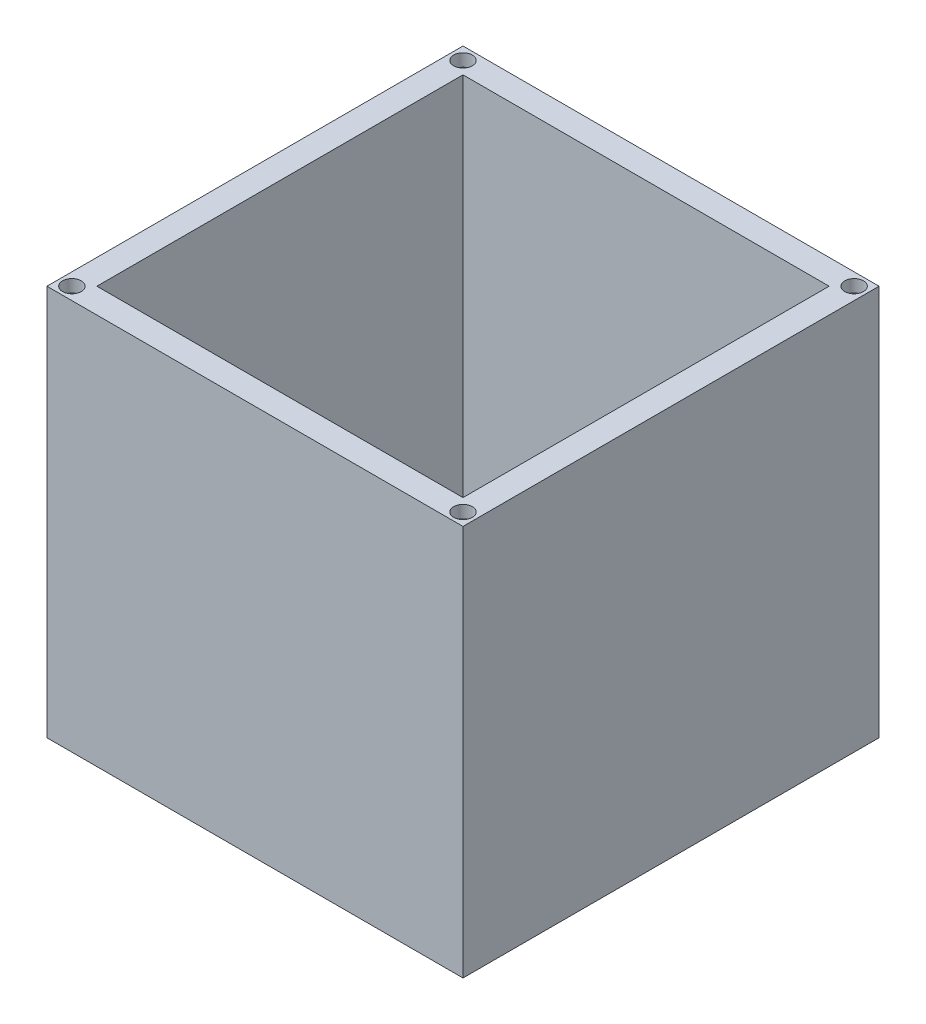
from build123d import *

# Parameters (mm, degrees)
SKETCH1_W           = 100
SKETCH1_H           = 100
BOSS_EXTRUDE1_DEPTH = 94
SKETCH2_W           = 88
SKETCH2_H           = 88
CUT_EXTRUDE1_DEPTH  = 88
SKETCH3_R           = 2.25
CUT_EXTRUDE2_DEPTH  = 3


with BuildPart() as part:
    # Sketch1 → Boss-Extrude1 (new body)
    with BuildSketch(Plane(origin=(0, 0, 0), x_dir=(1, 0, 0), z_dir=(0, 1, 0))):
        Rectangle(SKETCH1_W, SKETCH1_H)
    extrude(amount=-BOSS_EXTRUDE1_DEPTH)

    # Sketch2 → Cut-Extrude1 (cut)
    with BuildSketch(Plane(origin=(0, 0, 0), x_dir=(1, 0, 0), z_dir=(0, 1, 0))):
        Rectangle(SKETCH2_W, SKETCH2_H)
    extrude(amount=-CUT_EXTRUDE1_DEPTH, mode=Mode.SUBTRACT)

    # Sketch3 → Cut-Extrude2 (cut)
    with BuildSketch(Plane(origin=(0, 0, 0), x_dir=(1, 0, 0), z_dir=(0, 1, 0))):
        with Locations(Location((-47, 47, 0), (0, 0, 270))):
            Circle(SKETCH3_R)
        with Locations(Location((47, 47, 0), (0, 0, 270))):
            Circle(SKETCH3_R)
        with Locations(Location((47, -47, 0), (0, 0, 270))):
            Circle(SKETCH3_R)
        with Locations(Location((-47, -47, 0), (0, 0, 270))):
            Circle(SKETCH3_R)
    extrude(amount=-CUT_EXTRUDE2_DEPTH, mode=Mode.SUBTRACT)


solid = part.part
